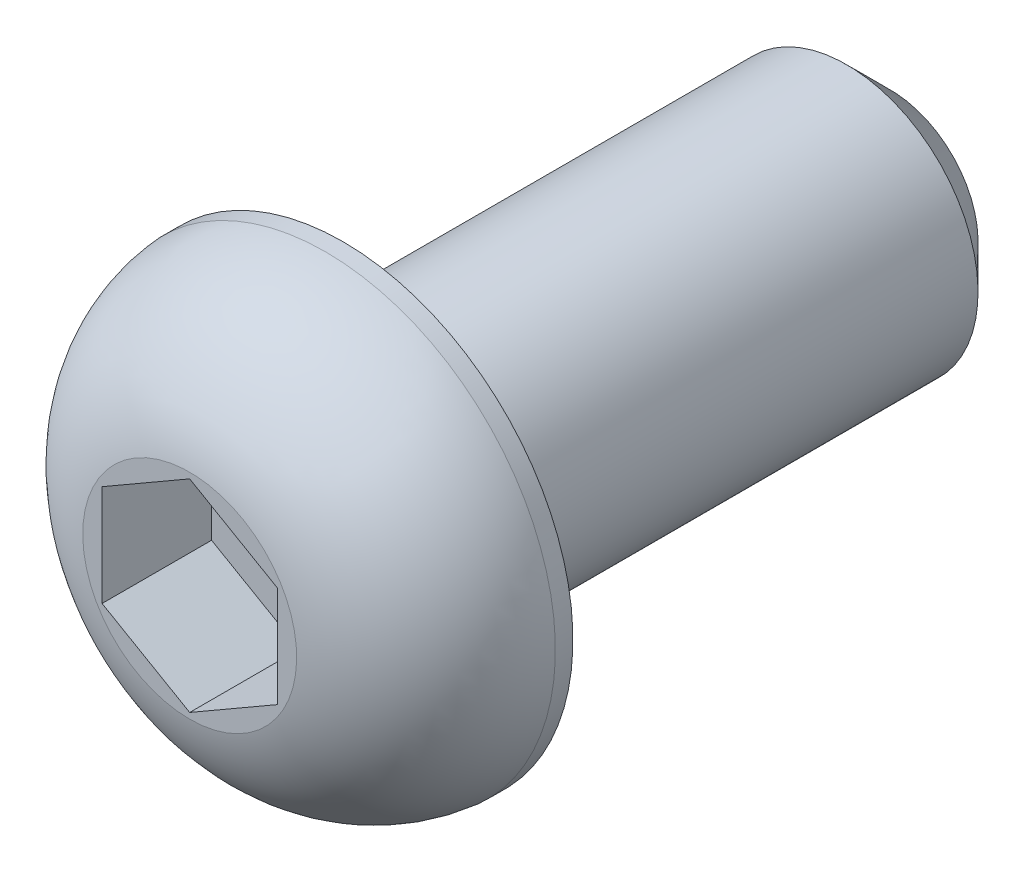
ISO-10303-21;
HEADER;
FILE_DESCRIPTION(('STEP AP214'),'2;1');
FILE_NAME('part.step','',(''),(''),'','','');
FILE_SCHEMA(('AUTOMOTIVE_DESIGN { 1 0 10303 214 1 1 1 1 }'));
ENDSEC;
DATA;
#1=APPLICATION_CONTEXT('core data for automotive mechanical design processes');
#2=APPLICATION_PROTOCOL_DEFINITION('international standard','automotive_design',2000,#1);
#3=PRODUCT_CONTEXT('',#1,'mechanical');
#4=PRODUCT('Part','Part','',(#3));
#5=PRODUCT_RELATED_PRODUCT_CATEGORY('part','',(#4));
#6=PRODUCT_DEFINITION_FORMATION('','',#4);
#7=PRODUCT_DEFINITION_CONTEXT('part definition',#1,'design');
#8=PRODUCT_DEFINITION('design','',#6,#7);
#9=PRODUCT_DEFINITION_SHAPE('','',#8);
#10=(LENGTH_UNIT() NAMED_UNIT(*) SI_UNIT(.MILLI.,.METRE.));
#11=(NAMED_UNIT(*) PLANE_ANGLE_UNIT() SI_UNIT($,.RADIAN.));
#12=(NAMED_UNIT(*) SI_UNIT($,.STERADIAN.) SOLID_ANGLE_UNIT());
#13=UNCERTAINTY_MEASURE_WITH_UNIT(LENGTH_MEASURE(1.E-05),#10,'distance_accuracy_value','');
#14=(GEOMETRIC_REPRESENTATION_CONTEXT(3) GLOBAL_UNCERTAINTY_ASSIGNED_CONTEXT((#13)) GLOBAL_UNIT_ASSIGNED_CONTEXT((#10,
#11,#12)) REPRESENTATION_CONTEXT('',''));
#15=CARTESIAN_POINT('',(0.,0.,0.));
#16=DIRECTION('',(0.,0.,1.));
#17=DIRECTION('',(1.,0.,0.));
#18=AXIS2_PLACEMENT_3D('',#15,#16,#17);
#19=CARTESIAN_POINT('',(0.,0.,7.));
#20=DIRECTION('',(0.,0.,1.));
#21=DIRECTION('',(0.,-1.,0.));
#22=AXIS2_PLACEMENT_3D('',#19,#20,#21);
#23=PLANE('',#22);
#24=CARTESIAN_POINT('',(0.,0.,7.));
#25=DIRECTION('',(0.,0.,1.));
#26=DIRECTION('',(0.,-1.,0.));
#27=AXIS2_PLACEMENT_3D('',#24,#25,#26);
#28=CIRCLE('',#27,4.88468858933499);
#29=CARTESIAN_POINT('',(0.,-4.88468858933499,7.));
#30=VERTEX_POINT('',#29);
#31=EDGE_CURVE('E70',#30,#30,#28,.T.);
#32=ORIENTED_EDGE('',*,*,#31,.T.);
#33=EDGE_LOOP('',(#32));
#34=FACE_BOUND('',#33,.T.);
#35=DIRECTION('',(0.,-1.,0.));
#36=VECTOR('',#35,1.);
#37=CARTESIAN_POINT('',(4.,2.30940107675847,7.));
#38=LINE('',#37,#36);
#39=CARTESIAN_POINT('',(4.,2.30940107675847,7.));
#40=VERTEX_POINT('',#39);
#41=CARTESIAN_POINT('',(4.,-2.30940107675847,7.));
#42=VERTEX_POINT('',#41);
#43=EDGE_CURVE('E84',#40,#42,#38,.T.);
#44=ORIENTED_EDGE('',*,*,#43,.T.);
#45=DIRECTION('',(-0.86602540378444,-0.5,0.));
#46=VECTOR('',#45,1.);
#47=CARTESIAN_POINT('',(4.,-2.30940107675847,7.));
#48=LINE('',#47,#46);
#49=CARTESIAN_POINT('',(0.,-4.61880215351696,7.));
#50=VERTEX_POINT('',#49);
#51=EDGE_CURVE('E29',#42,#50,#48,.T.);
#52=ORIENTED_EDGE('',*,*,#51,.T.);
#53=DIRECTION('',(0.86602540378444,-0.5,0.));
#54=VECTOR('',#53,1.);
#55=CARTESIAN_POINT('',(-4.,-2.30940107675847,7.));
#56=LINE('',#55,#54);
#57=CARTESIAN_POINT('',(-4.,-2.30940107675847,7.));
#58=VERTEX_POINT('',#57);
#59=EDGE_CURVE('E74',#58,#50,#56,.T.);
#60=ORIENTED_EDGE('',*,*,#59,.F.);
#61=DIRECTION('',(0.,-1.,0.));
#62=VECTOR('',#61,1.);
#63=CARTESIAN_POINT('',(-4.,2.30940107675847,7.));
#64=LINE('',#63,#62);
#65=CARTESIAN_POINT('',(-4.,2.30940107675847,7.));
#66=VERTEX_POINT('',#65);
#67=EDGE_CURVE('E79',#66,#58,#64,.T.);
#68=ORIENTED_EDGE('',*,*,#67,.F.);
#69=DIRECTION('',(0.86602540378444,0.5,0.));
#70=VECTOR('',#69,1.);
#71=CARTESIAN_POINT('',(-4.,2.30940107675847,7.));
#72=LINE('',#71,#70);
#73=CARTESIAN_POINT('',(0.,4.61880215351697,7.));
#74=VERTEX_POINT('',#73);
#75=EDGE_CURVE('E88',#66,#74,#72,.T.);
#76=ORIENTED_EDGE('',*,*,#75,.T.);
#77=DIRECTION('',(-0.86602540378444,0.5,0.));
#78=VECTOR('',#77,1.);
#79=CARTESIAN_POINT('',(4.,2.30940107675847,7.));
#80=LINE('',#79,#78);
#81=EDGE_CURVE('E91',#40,#74,#80,.T.);
#82=ORIENTED_EDGE('',*,*,#81,.F.);
#83=EDGE_LOOP('',(#44,#52,#60,#68,#76,#82));
#84=FACE_BOUND('',#83,.T.);
#85=ADVANCED_FACE('F14',(#34,#84),#23,.T.);
#86=CARTESIAN_POINT('',(0.,4.00000000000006,-25.));
#87=DIRECTION('',(0.,0.,-1.));
#88=DIRECTION('',(0.,1.,0.));
#89=AXIS2_PLACEMENT_3D('',#86,#87,#88);
#90=PLANE('',#89);
#91=CARTESIAN_POINT('',(0.,0.,-25.));
#92=DIRECTION('',(0.,0.,1.));
#93=DIRECTION('',(0.,-1.,0.));
#94=AXIS2_PLACEMENT_3D('',#91,#92,#93);
#95=CIRCLE('',#94,4.00000000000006);
#96=CARTESIAN_POINT('',(0.,-4.00000000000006,-25.));
#97=VERTEX_POINT('',#96);
#98=EDGE_CURVE('E9',#97,#97,#95,.T.);
#99=ORIENTED_EDGE('',*,*,#98,.F.);
#100=EDGE_LOOP('',(#99));
#101=FACE_BOUND('',#100,.T.);
#102=ADVANCED_FACE('F16',(#101),#90,.T.);
#103=CARTESIAN_POINT('',(0.,0.,-25.));
#104=DIRECTION('',(0.,0.,1.));
#105=DIRECTION('',(0.,-1.,0.));
#106=AXIS2_PLACEMENT_3D('',#103,#104,#105);
#107=CONICAL_SURFACE('',#106,4.00000000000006,0.785398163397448);
#108=CARTESIAN_POINT('',(0.,0.,-23.));
#109=DIRECTION('',(0.,0.,1.));
#110=DIRECTION('',(0.,-1.,0.));
#111=AXIS2_PLACEMENT_3D('',#108,#109,#110);
#112=CIRCLE('',#111,6.);
#113=CARTESIAN_POINT('',(0.,-6.,-23.));
#114=VERTEX_POINT('',#113);
#115=EDGE_CURVE('E22',#114,#114,#112,.T.);
#116=ORIENTED_EDGE('',*,*,#115,.F.);
#117=EDGE_LOOP('',(#116));
#118=FACE_BOUND('',#117,.T.);
#119=ORIENTED_EDGE('',*,*,#98,.T.);
#120=EDGE_LOOP('',(#119));
#121=FACE_BOUND('',#120,.T.);
#122=ADVANCED_FACE('F134',(#118,#121),#107,.T.);
#123=CARTESIAN_POINT('',(0.,0.,15.));
#124=DIRECTION('',(0.,0.,1.));
#125=DIRECTION('',(0.,-1.,0.));
#126=AXIS2_PLACEMENT_3D('',#123,#124,#125);
#127=CYLINDRICAL_SURFACE('',#126,6.);
#128=ORIENTED_EDGE('',*,*,#115,.T.);
#129=EDGE_LOOP('',(#128));
#130=FACE_BOUND('',#129,.T.);
#131=CARTESIAN_POINT('',(0.,0.,0.));
#132=DIRECTION('',(0.,0.,1.));
#133=DIRECTION('',(0.,-1.,0.));
#134=AXIS2_PLACEMENT_3D('',#131,#132,#133);
#135=CIRCLE('',#134,6.);
#136=CARTESIAN_POINT('',(0.,-6.,0.));
#137=VERTEX_POINT('',#136);
#138=EDGE_CURVE('E126',#137,#137,#135,.T.);
#139=ORIENTED_EDGE('',*,*,#138,.F.);
#140=EDGE_LOOP('',(#139));
#141=FACE_BOUND('',#140,.T.);
#142=ADVANCED_FACE('F131',(#130,#141),#127,.T.);
#143=CARTESIAN_POINT('',(0.,6.,0.));
#144=DIRECTION('',(0.,0.,1.));
#145=DIRECTION('',(0.,-1.,0.));
#146=AXIS2_PLACEMENT_3D('',#143,#144,#145);
#147=PLANE('',#146);
#148=CARTESIAN_POINT('',(0.,0.,0.));
#149=DIRECTION('',(0.,0.,1.));
#150=DIRECTION('',(0.,-1.,0.));
#151=AXIS2_PLACEMENT_3D('',#148,#149,#150);
#152=CIRCLE('',#151,10.4999999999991);
#153=CARTESIAN_POINT('',(0.,-10.4999999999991,0.));
#154=VERTEX_POINT('',#153);
#155=EDGE_CURVE('E123',#154,#154,#152,.T.);
#156=ORIENTED_EDGE('',*,*,#155,.F.);
#157=EDGE_LOOP('',(#156));
#158=FACE_BOUND('',#157,.T.);
#159=ORIENTED_EDGE('',*,*,#138,.T.);
#160=EDGE_LOOP('',(#159));
#161=FACE_BOUND('',#160,.T.);
#162=ADVANCED_FACE('F160',(#158,#161),#147,.F.);
#163=CARTESIAN_POINT('',(0.,0.,15.));
#164=DIRECTION('',(0.,0.,1.));
#165=DIRECTION('',(0.,-1.,0.));
#166=AXIS2_PLACEMENT_3D('',#163,#164,#165);
#167=CYLINDRICAL_SURFACE('',#166,10.4999999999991);
#168=ORIENTED_EDGE('',*,*,#155,.T.);
#169=EDGE_LOOP('',(#168));
#170=FACE_BOUND('',#169,.T.);
#171=CARTESIAN_POINT('',(0.,0.,0.799999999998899));
#172=DIRECTION('',(0.,0.,1.));
#173=DIRECTION('',(0.,-1.,0.));
#174=AXIS2_PLACEMENT_3D('',#171,#172,#173);
#175=CIRCLE('',#174,10.4999999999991);
#176=CARTESIAN_POINT('',(0.,-10.4999999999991,0.7999999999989));
#177=VERTEX_POINT('',#176);
#178=EDGE_CURVE('E120',#177,#177,#175,.T.);
#179=ORIENTED_EDGE('',*,*,#178,.F.);
#180=EDGE_LOOP('',(#179));
#181=FACE_BOUND('',#180,.T.);
#182=ADVANCED_FACE('F156',(#170,#181),#167,.T.);
#183=CARTESIAN_POINT('',(0.,0.,0.131950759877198));
#184=DIRECTION('',(0.,0.,1.));
#185=DIRECTION('',(0.,-1.,0.));
#186=AXIS2_PLACEMENT_3D('',#183,#184,#185);
#187=DEGENERATE_TOROIDAL_SURFACE('',#186,3.5319507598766,6.99999999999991,.T.);
#188=ORIENTED_EDGE('',*,*,#31,.F.);
#189=EDGE_LOOP('',(#188));
#190=FACE_BOUND('',#189,.T.);
#191=ORIENTED_EDGE('',*,*,#178,.T.);
#192=EDGE_LOOP('',(#191));
#193=FACE_BOUND('',#192,.T.);
#194=ADVANCED_FACE('F153',(#190,#193),#187,.T.);
#195=CARTESIAN_POINT('',(4.,-2.30940107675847,2.));
#196=DIRECTION('',(-0.5,0.86602540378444,0.));
#197=DIRECTION('',(-0.86602540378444,-0.5,0.));
#198=AXIS2_PLACEMENT_3D('',#195,#196,#197);
#199=PLANE('',#198);
#200=DIRECTION('',(0.,0.,1.));
#201=VECTOR('',#200,1.);
#202=CARTESIAN_POINT('',(0.,-4.61880215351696,2.));
#203=LINE('',#202,#201);
#204=CARTESIAN_POINT('',(0.,-4.61880215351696,2.));
#205=VERTEX_POINT('',#204);
#206=EDGE_CURVE('E63',#205,#50,#203,.T.);
#207=ORIENTED_EDGE('',*,*,#206,.T.);
#208=ORIENTED_EDGE('',*,*,#51,.F.);
#209=DIRECTION('',(0.,0.,1.));
#210=VECTOR('',#209,1.);
#211=CARTESIAN_POINT('',(4.,-2.30940107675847,2.));
#212=LINE('',#211,#210);
#213=CARTESIAN_POINT('',(4.,-2.30940107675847,2.));
#214=VERTEX_POINT('',#213);
#215=EDGE_CURVE('E33',#214,#42,#212,.T.);
#216=ORIENTED_EDGE('',*,*,#215,.F.);
#217=DIRECTION('',(-0.86602540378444,-0.5,0.));
#218=VECTOR('',#217,1.);
#219=CARTESIAN_POINT('',(4.,-2.30940107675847,2.));
#220=LINE('',#219,#218);
#221=EDGE_CURVE('E66',#214,#205,#220,.T.);
#222=ORIENTED_EDGE('',*,*,#221,.T.);
#223=EDGE_LOOP('',(#207,#208,#216,#222));
#224=FACE_BOUND('',#223,.T.);
#225=ADVANCED_FACE('F65',(#224),#199,.T.);
#226=CARTESIAN_POINT('',(-4.,-2.30940107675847,2.));
#227=DIRECTION('',(-0.5,-0.86602540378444,0.));
#228=DIRECTION('',(0.86602540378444,-0.5,0.));
#229=AXIS2_PLACEMENT_3D('',#226,#227,#228);
#230=PLANE('',#229);
#231=DIRECTION('',(0.,0.,1.));
#232=VECTOR('',#231,1.);
#233=CARTESIAN_POINT('',(-4.,-2.30940107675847,2.));
#234=LINE('',#233,#232);
#235=CARTESIAN_POINT('',(-4.,-2.30940107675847,2.));
#236=VERTEX_POINT('',#235);
#237=EDGE_CURVE('E71',#236,#58,#234,.T.);
#238=ORIENTED_EDGE('',*,*,#237,.T.);
#239=ORIENTED_EDGE('',*,*,#59,.T.);
#240=ORIENTED_EDGE('',*,*,#206,.F.);
#241=DIRECTION('',(0.86602540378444,-0.5,0.));
#242=VECTOR('',#241,1.);
#243=CARTESIAN_POINT('',(-4.,-2.30940107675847,2.));
#244=LINE('',#243,#242);
#245=EDGE_CURVE('E96',#236,#205,#244,.T.);
#246=ORIENTED_EDGE('',*,*,#245,.F.);
#247=EDGE_LOOP('',(#238,#239,#240,#246));
#248=FACE_BOUND('',#247,.T.);
#249=ADVANCED_FACE('F75',(#248),#230,.F.);
#250=CARTESIAN_POINT('',(-4.,2.30940107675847,2.));
#251=DIRECTION('',(-1.,0.,0.));
#252=DIRECTION('',(0.,-1.,0.));
#253=AXIS2_PLACEMENT_3D('',#250,#251,#252);
#254=PLANE('',#253);
#255=DIRECTION('',(0.,0.,1.));
#256=VECTOR('',#255,1.);
#257=CARTESIAN_POINT('',(-4.,2.30940107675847,2.));
#258=LINE('',#257,#256);
#259=CARTESIAN_POINT('',(-4.,2.30940107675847,2.));
#260=VERTEX_POINT('',#259);
#261=EDGE_CURVE('E115',#260,#66,#258,.T.);
#262=ORIENTED_EDGE('',*,*,#261,.T.);
#263=ORIENTED_EDGE('',*,*,#67,.T.);
#264=ORIENTED_EDGE('',*,*,#237,.F.);
#265=DIRECTION('',(0.,-1.,0.));
#266=VECTOR('',#265,1.);
#267=CARTESIAN_POINT('',(-4.,2.30940107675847,2.));
#268=LINE('',#267,#266);
#269=EDGE_CURVE('E98',#260,#236,#268,.T.);
#270=ORIENTED_EDGE('',*,*,#269,.F.);
#271=EDGE_LOOP('',(#262,#263,#264,#270));
#272=FACE_BOUND('',#271,.T.);
#273=ADVANCED_FACE('F204',(#272),#254,.F.);
#274=CARTESIAN_POINT('',(-4.,2.30940107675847,2.));
#275=DIRECTION('',(0.5,-0.86602540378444,0.));
#276=DIRECTION('',(0.86602540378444,0.5,0.));
#277=AXIS2_PLACEMENT_3D('',#274,#275,#276);
#278=PLANE('',#277);
#279=DIRECTION('',(0.,0.,1.));
#280=VECTOR('',#279,1.);
#281=CARTESIAN_POINT('',(0.,4.61880215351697,2.));
#282=LINE('',#281,#280);
#283=CARTESIAN_POINT('',(0.,4.61880215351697,2.));
#284=VERTEX_POINT('',#283);
#285=EDGE_CURVE('E113',#284,#74,#282,.T.);
#286=ORIENTED_EDGE('',*,*,#285,.T.);
#287=ORIENTED_EDGE('',*,*,#75,.F.);
#288=ORIENTED_EDGE('',*,*,#261,.F.);
#289=DIRECTION('',(0.86602540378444,0.5,0.));
#290=VECTOR('',#289,1.);
#291=CARTESIAN_POINT('',(-4.,2.30940107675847,2.));
#292=LINE('',#291,#290);
#293=EDGE_CURVE('E101',#260,#284,#292,.T.);
#294=ORIENTED_EDGE('',*,*,#293,.T.);
#295=EDGE_LOOP('',(#286,#287,#288,#294));
#296=FACE_BOUND('',#295,.T.);
#297=ADVANCED_FACE('F211',(#296),#278,.T.);
#298=CARTESIAN_POINT('',(4.,2.30940107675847,2.));
#299=DIRECTION('',(0.5,0.86602540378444,0.));
#300=DIRECTION('',(-0.86602540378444,0.5,0.));
#301=AXIS2_PLACEMENT_3D('',#298,#299,#300);
#302=PLANE('',#301);
#303=DIRECTION('',(0.,0.,1.));
#304=VECTOR('',#303,1.);
#305=CARTESIAN_POINT('',(4.,2.30940107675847,2.));
#306=LINE('',#305,#304);
#307=CARTESIAN_POINT('',(4.,2.30940107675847,2.));
#308=VERTEX_POINT('',#307);
#309=EDGE_CURVE('E111',#308,#40,#306,.T.);
#310=ORIENTED_EDGE('',*,*,#309,.T.);
#311=ORIENTED_EDGE('',*,*,#81,.T.);
#312=ORIENTED_EDGE('',*,*,#285,.F.);
#313=DIRECTION('',(-0.86602540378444,0.5,0.));
#314=VECTOR('',#313,1.);
#315=CARTESIAN_POINT('',(4.,2.30940107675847,2.));
#316=LINE('',#315,#314);
#317=EDGE_CURVE('E104',#308,#284,#316,.T.);
#318=ORIENTED_EDGE('',*,*,#317,.F.);
#319=EDGE_LOOP('',(#310,#311,#312,#318));
#320=FACE_BOUND('',#319,.T.);
#321=ADVANCED_FACE('F219',(#320),#302,.F.);
#322=CARTESIAN_POINT('',(4.,2.30940107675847,2.));
#323=DIRECTION('',(-1.,0.,0.));
#324=DIRECTION('',(0.,-1.,0.));
#325=AXIS2_PLACEMENT_3D('',#322,#323,#324);
#326=PLANE('',#325);
#327=DIRECTION('',(0.,-1.,0.));
#328=VECTOR('',#327,1.);
#329=CARTESIAN_POINT('',(4.,2.30940107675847,2.));
#330=LINE('',#329,#328);
#331=EDGE_CURVE('E107',#308,#214,#330,.T.);
#332=ORIENTED_EDGE('',*,*,#331,.T.);
#333=ORIENTED_EDGE('',*,*,#215,.T.);
#334=ORIENTED_EDGE('',*,*,#43,.F.);
#335=ORIENTED_EDGE('',*,*,#309,.F.);
#336=EDGE_LOOP('',(#332,#333,#334,#335));
#337=FACE_BOUND('',#336,.T.);
#338=ADVANCED_FACE('F228',(#337),#326,.T.);
#339=CARTESIAN_POINT('',(-4.,-6.92820323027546,2.));
#340=DIRECTION('',(0.,0.,1.));
#341=DIRECTION('',(1.,0.,0.));
#342=AXIS2_PLACEMENT_3D('',#339,#340,#341);
#343=PLANE('',#342);
#344=ORIENTED_EDGE('',*,*,#221,.F.);
#345=ORIENTED_EDGE('',*,*,#331,.F.);
#346=ORIENTED_EDGE('',*,*,#317,.T.);
#347=ORIENTED_EDGE('',*,*,#293,.F.);
#348=ORIENTED_EDGE('',*,*,#269,.T.);
#349=ORIENTED_EDGE('',*,*,#245,.T.);
#350=EDGE_LOOP('',(#344,#345,#346,#347,#348,#349));
#351=FACE_BOUND('',#350,.T.);
#352=ADVANCED_FACE('F231',(#351),#343,.T.);
#353=CLOSED_SHELL('',(#85,#102,#122,#142,#162,#182,#194,#225,#249,#273,#297,#321,#338,#352));
#354=MANIFOLD_SOLID_BREP('B1',#353);
#355=ADVANCED_BREP_SHAPE_REPRESENTATION('',(#18,#354),#14);
#356=SHAPE_DEFINITION_REPRESENTATION(#9,#355);
ENDSEC;
END-ISO-10303-21;
